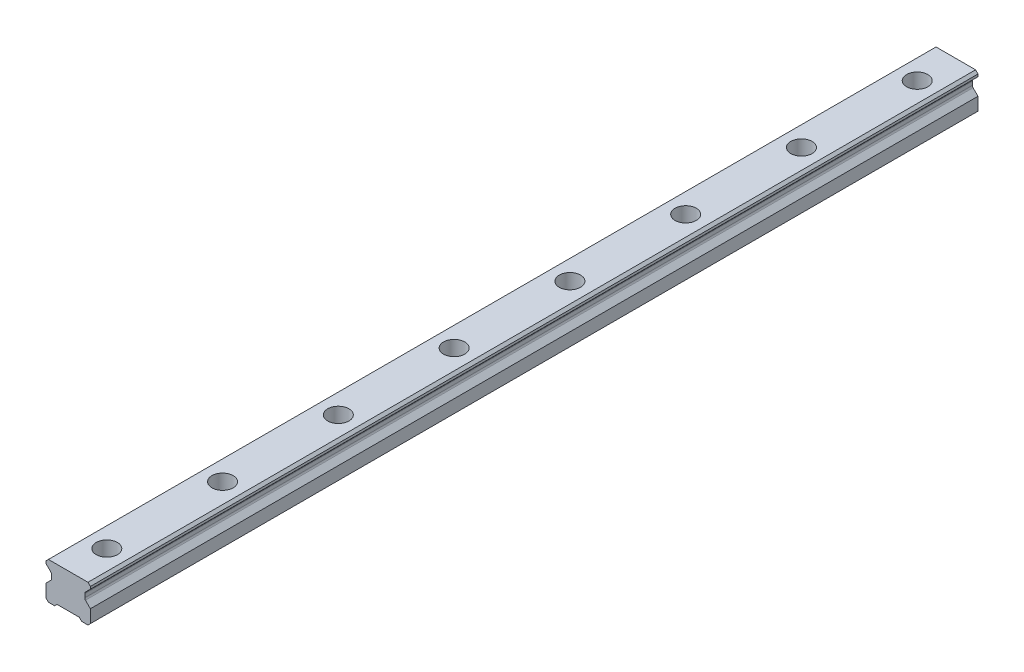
ISO-10303-21;
HEADER;
FILE_DESCRIPTION(('STEP AP214'),'2;1');
FILE_NAME('part.step','',(''),(''),'','','');
FILE_SCHEMA(('AUTOMOTIVE_DESIGN { 1 0 10303 214 1 1 1 1 }'));
ENDSEC;
DATA;
#1=APPLICATION_CONTEXT('core data for automotive mechanical design processes');
#2=APPLICATION_PROTOCOL_DEFINITION('international standard','automotive_design',2000,#1);
#3=PRODUCT_CONTEXT('',#1,'mechanical');
#4=PRODUCT('Part','Part','',(#3));
#5=PRODUCT_RELATED_PRODUCT_CATEGORY('part','',(#4));
#6=PRODUCT_DEFINITION_FORMATION('','',#4);
#7=PRODUCT_DEFINITION_CONTEXT('part definition',#1,'design');
#8=PRODUCT_DEFINITION('design','',#6,#7);
#9=PRODUCT_DEFINITION_SHAPE('','',#8);
#10=(LENGTH_UNIT() NAMED_UNIT(*) SI_UNIT(.MILLI.,.METRE.));
#11=(NAMED_UNIT(*) PLANE_ANGLE_UNIT() SI_UNIT($,.RADIAN.));
#12=(NAMED_UNIT(*) SI_UNIT($,.STERADIAN.) SOLID_ANGLE_UNIT());
#13=UNCERTAINTY_MEASURE_WITH_UNIT(LENGTH_MEASURE(1.E-05),#10,'distance_accuracy_value','');
#14=(GEOMETRIC_REPRESENTATION_CONTEXT(3) GLOBAL_UNCERTAINTY_ASSIGNED_CONTEXT((#13)) GLOBAL_UNIT_ASSIGNED_CONTEXT((#10,
#11,#12)) REPRESENTATION_CONTEXT('',''));
#15=CARTESIAN_POINT('',(0.,0.,0.));
#16=DIRECTION('',(0.,0.,1.));
#17=DIRECTION('',(1.,0.,0.));
#18=AXIS2_PLACEMENT_3D('',#15,#16,#17);
#19=CARTESIAN_POINT('',(0.,10.2,-210.));
#20=DIRECTION('',(0.,1.,0.));
#21=DIRECTION('',(0.,0.,1.));
#22=AXIS2_PLACEMENT_3D('',#19,#20,#21);
#23=PLANE('',#22);
#24=CARTESIAN_POINT('',(0.,10.2,-210.));
#25=DIRECTION('',(0.,1.,0.));
#26=DIRECTION('',(0.,0.,1.));
#27=AXIS2_PLACEMENT_3D('',#24,#25,#26);
#28=CIRCLE('',#27,3.5);
#29=CARTESIAN_POINT('',(0.,10.2,-206.5));
#30=VERTEX_POINT('',#29);
#31=EDGE_CURVE('E406',#30,#30,#28,.T.);
#32=ORIENTED_EDGE('',*,*,#31,.F.);
#33=EDGE_LOOP('',(#32));
#34=FACE_BOUND('',#33,.T.);
#35=CARTESIAN_POINT('',(0.,10.2,-210.));
#36=DIRECTION('',(0.,1.,0.));
#37=DIRECTION('',(0.,0.,1.));
#38=AXIS2_PLACEMENT_3D('',#35,#36,#37);
#39=CIRCLE('',#38,5.5);
#40=CARTESIAN_POINT('',(0.,10.2,-204.5));
#41=VERTEX_POINT('',#40);
#42=EDGE_CURVE('E11',#41,#41,#39,.T.);
#43=ORIENTED_EDGE('',*,*,#42,.T.);
#44=EDGE_LOOP('',(#43));
#45=FACE_BOUND('',#44,.T.);
#46=ADVANCED_FACE('F39',(#34,#45),#23,.T.);
#47=CARTESIAN_POINT('',(0.,10.2,-210.));
#48=DIRECTION('',(0.,1.,0.));
#49=DIRECTION('',(0.,0.,1.));
#50=AXIS2_PLACEMENT_3D('',#47,#48,#49);
#51=CYLINDRICAL_SURFACE('',#50,5.5);
#52=ORIENTED_EDGE('',*,*,#42,.F.);
#53=EDGE_LOOP('',(#52));
#54=FACE_BOUND('',#53,.T.);
#55=CARTESIAN_POINT('',(0.,19.2,-210.));
#56=DIRECTION('',(0.,1.,0.));
#57=DIRECTION('',(0.,0.,1.));
#58=AXIS2_PLACEMENT_3D('',#55,#56,#57);
#59=CIRCLE('',#58,5.5);
#60=CARTESIAN_POINT('',(0.,19.2,-204.5));
#61=VERTEX_POINT('',#60);
#62=EDGE_CURVE('E48',#61,#61,#59,.T.);
#63=ORIENTED_EDGE('',*,*,#62,.T.);
#64=EDGE_LOOP('',(#63));
#65=FACE_BOUND('',#64,.T.);
#66=ADVANCED_FACE('F663',(#54,#65),#51,.F.);
#67=CARTESIAN_POINT('',(0.,10.2,-150.));
#68=DIRECTION('',(0.,1.,0.));
#69=DIRECTION('',(0.,0.,1.));
#70=AXIS2_PLACEMENT_3D('',#67,#68,#69);
#71=PLANE('',#70);
#72=CARTESIAN_POINT('',(0.,10.2,-150.));
#73=DIRECTION('',(0.,1.,0.));
#74=DIRECTION('',(0.,0.,1.));
#75=AXIS2_PLACEMENT_3D('',#72,#73,#74);
#76=CIRCLE('',#75,3.5);
#77=CARTESIAN_POINT('',(0.,10.2,-146.5));
#78=VERTEX_POINT('',#77);
#79=EDGE_CURVE('E411',#78,#78,#76,.T.);
#80=ORIENTED_EDGE('',*,*,#79,.F.);
#81=EDGE_LOOP('',(#80));
#82=FACE_BOUND('',#81,.T.);
#83=CARTESIAN_POINT('',(0.,10.2,-150.));
#84=DIRECTION('',(0.,1.,0.));
#85=DIRECTION('',(0.,0.,1.));
#86=AXIS2_PLACEMENT_3D('',#83,#84,#85);
#87=CIRCLE('',#86,5.5);
#88=CARTESIAN_POINT('',(0.,10.2,-144.5));
#89=VERTEX_POINT('',#88);
#90=EDGE_CURVE('E390',#89,#89,#87,.T.);
#91=ORIENTED_EDGE('',*,*,#90,.T.);
#92=EDGE_LOOP('',(#91));
#93=FACE_BOUND('',#92,.T.);
#94=ADVANCED_FACE('F659',(#82,#93),#71,.T.);
#95=CARTESIAN_POINT('',(0.,10.2,-150.));
#96=DIRECTION('',(0.,1.,0.));
#97=DIRECTION('',(0.,0.,1.));
#98=AXIS2_PLACEMENT_3D('',#95,#96,#97);
#99=CYLINDRICAL_SURFACE('',#98,5.5);
#100=ORIENTED_EDGE('',*,*,#90,.F.);
#101=EDGE_LOOP('',(#100));
#102=FACE_BOUND('',#101,.T.);
#103=CARTESIAN_POINT('',(0.,19.2,-150.));
#104=DIRECTION('',(0.,1.,0.));
#105=DIRECTION('',(0.,0.,1.));
#106=AXIS2_PLACEMENT_3D('',#103,#104,#105);
#107=CIRCLE('',#106,5.5);
#108=CARTESIAN_POINT('',(0.,19.2,-144.5));
#109=VERTEX_POINT('',#108);
#110=EDGE_CURVE('E386',#109,#109,#107,.T.);
#111=ORIENTED_EDGE('',*,*,#110,.T.);
#112=EDGE_LOOP('',(#111));
#113=FACE_BOUND('',#112,.T.);
#114=ADVANCED_FACE('F662',(#102,#113),#99,.F.);
#115=CARTESIAN_POINT('',(0.,10.2,-90.));
#116=DIRECTION('',(0.,1.,0.));
#117=DIRECTION('',(0.,0.,1.));
#118=AXIS2_PLACEMENT_3D('',#115,#116,#117);
#119=PLANE('',#118);
#120=CARTESIAN_POINT('',(0.,10.2,-90.));
#121=DIRECTION('',(0.,1.,0.));
#122=DIRECTION('',(0.,0.,1.));
#123=AXIS2_PLACEMENT_3D('',#120,#121,#122);
#124=CIRCLE('',#123,3.5);
#125=CARTESIAN_POINT('',(0.,10.2,-86.5));
#126=VERTEX_POINT('',#125);
#127=EDGE_CURVE('E416',#126,#126,#124,.T.);
#128=ORIENTED_EDGE('',*,*,#127,.F.);
#129=EDGE_LOOP('',(#128));
#130=FACE_BOUND('',#129,.T.);
#131=CARTESIAN_POINT('',(0.,10.2,-90.));
#132=DIRECTION('',(0.,1.,0.));
#133=DIRECTION('',(0.,0.,1.));
#134=AXIS2_PLACEMENT_3D('',#131,#132,#133);
#135=CIRCLE('',#134,5.5);
#136=CARTESIAN_POINT('',(0.,10.2,-84.5));
#137=VERTEX_POINT('',#136);
#138=EDGE_CURVE('E382',#137,#137,#135,.T.);
#139=ORIENTED_EDGE('',*,*,#138,.T.);
#140=EDGE_LOOP('',(#139));
#141=FACE_BOUND('',#140,.T.);
#142=ADVANCED_FACE('F669',(#130,#141),#119,.T.);
#143=CARTESIAN_POINT('',(0.,10.2,-90.));
#144=DIRECTION('',(0.,1.,0.));
#145=DIRECTION('',(0.,0.,1.));
#146=AXIS2_PLACEMENT_3D('',#143,#144,#145);
#147=CYLINDRICAL_SURFACE('',#146,5.5);
#148=ORIENTED_EDGE('',*,*,#138,.F.);
#149=EDGE_LOOP('',(#148));
#150=FACE_BOUND('',#149,.T.);
#151=CARTESIAN_POINT('',(0.,19.2,-90.));
#152=DIRECTION('',(0.,1.,0.));
#153=DIRECTION('',(0.,0.,1.));
#154=AXIS2_PLACEMENT_3D('',#151,#152,#153);
#155=CIRCLE('',#154,5.5);
#156=CARTESIAN_POINT('',(0.,19.2,-84.5));
#157=VERTEX_POINT('',#156);
#158=EDGE_CURVE('E378',#157,#157,#155,.T.);
#159=ORIENTED_EDGE('',*,*,#158,.T.);
#160=EDGE_LOOP('',(#159));
#161=FACE_BOUND('',#160,.T.);
#162=ADVANCED_FACE('F690',(#150,#161),#147,.F.);
#163=CARTESIAN_POINT('',(0.,10.2,-30.));
#164=DIRECTION('',(0.,1.,0.));
#165=DIRECTION('',(0.,0.,1.));
#166=AXIS2_PLACEMENT_3D('',#163,#164,#165);
#167=PLANE('',#166);
#168=CARTESIAN_POINT('',(0.,10.2,-30.));
#169=DIRECTION('',(0.,1.,0.));
#170=DIRECTION('',(0.,0.,1.));
#171=AXIS2_PLACEMENT_3D('',#168,#169,#170);
#172=CIRCLE('',#171,3.5);
#173=CARTESIAN_POINT('',(0.,10.2,-26.5));
#174=VERTEX_POINT('',#173);
#175=EDGE_CURVE('E420',#174,#174,#172,.T.);
#176=ORIENTED_EDGE('',*,*,#175,.F.);
#177=EDGE_LOOP('',(#176));
#178=FACE_BOUND('',#177,.T.);
#179=CARTESIAN_POINT('',(0.,10.2,-30.));
#180=DIRECTION('',(0.,1.,0.));
#181=DIRECTION('',(0.,0.,1.));
#182=AXIS2_PLACEMENT_3D('',#179,#180,#181);
#183=CIRCLE('',#182,5.5);
#184=CARTESIAN_POINT('',(0.,10.2,-24.5));
#185=VERTEX_POINT('',#184);
#186=EDGE_CURVE('E374',#185,#185,#183,.T.);
#187=ORIENTED_EDGE('',*,*,#186,.T.);
#188=EDGE_LOOP('',(#187));
#189=FACE_BOUND('',#188,.T.);
#190=ADVANCED_FACE('F694',(#178,#189),#167,.T.);
#191=CARTESIAN_POINT('',(0.,10.2,-30.));
#192=DIRECTION('',(0.,1.,0.));
#193=DIRECTION('',(0.,0.,1.));
#194=AXIS2_PLACEMENT_3D('',#191,#192,#193);
#195=CYLINDRICAL_SURFACE('',#194,5.5);
#196=ORIENTED_EDGE('',*,*,#186,.F.);
#197=EDGE_LOOP('',(#196));
#198=FACE_BOUND('',#197,.T.);
#199=CARTESIAN_POINT('',(0.,19.2,-30.));
#200=DIRECTION('',(0.,1.,0.));
#201=DIRECTION('',(0.,0.,1.));
#202=AXIS2_PLACEMENT_3D('',#199,#200,#201);
#203=CIRCLE('',#202,5.5);
#204=CARTESIAN_POINT('',(0.,19.2,-24.5));
#205=VERTEX_POINT('',#204);
#206=EDGE_CURVE('E370',#205,#205,#203,.T.);
#207=ORIENTED_EDGE('',*,*,#206,.T.);
#208=EDGE_LOOP('',(#207));
#209=FACE_BOUND('',#208,.T.);
#210=ADVANCED_FACE('F698',(#198,#209),#195,.F.);
#211=CARTESIAN_POINT('',(0.,10.2,30.));
#212=DIRECTION('',(0.,1.,0.));
#213=DIRECTION('',(0.,0.,1.));
#214=AXIS2_PLACEMENT_3D('',#211,#212,#213);
#215=PLANE('',#214);
#216=CARTESIAN_POINT('',(0.,10.2,30.));
#217=DIRECTION('',(0.,1.,0.));
#218=DIRECTION('',(0.,0.,1.));
#219=AXIS2_PLACEMENT_3D('',#216,#217,#218);
#220=CIRCLE('',#219,3.5);
#221=CARTESIAN_POINT('',(0.,10.2,33.5));
#222=VERTEX_POINT('',#221);
#223=EDGE_CURVE('E424',#222,#222,#220,.T.);
#224=ORIENTED_EDGE('',*,*,#223,.F.);
#225=EDGE_LOOP('',(#224));
#226=FACE_BOUND('',#225,.T.);
#227=CARTESIAN_POINT('',(0.,10.2,30.));
#228=DIRECTION('',(0.,1.,0.));
#229=DIRECTION('',(0.,0.,1.));
#230=AXIS2_PLACEMENT_3D('',#227,#228,#229);
#231=CIRCLE('',#230,5.5);
#232=CARTESIAN_POINT('',(0.,10.2,35.5));
#233=VERTEX_POINT('',#232);
#234=EDGE_CURVE('E366',#233,#233,#231,.T.);
#235=ORIENTED_EDGE('',*,*,#234,.T.);
#236=EDGE_LOOP('',(#235));
#237=FACE_BOUND('',#236,.T.);
#238=ADVANCED_FACE('F702',(#226,#237),#215,.T.);
#239=CARTESIAN_POINT('',(0.,10.2,30.));
#240=DIRECTION('',(0.,1.,0.));
#241=DIRECTION('',(0.,0.,1.));
#242=AXIS2_PLACEMENT_3D('',#239,#240,#241);
#243=CYLINDRICAL_SURFACE('',#242,5.5);
#244=ORIENTED_EDGE('',*,*,#234,.F.);
#245=EDGE_LOOP('',(#244));
#246=FACE_BOUND('',#245,.T.);
#247=CARTESIAN_POINT('',(0.,19.2,30.));
#248=DIRECTION('',(0.,1.,0.));
#249=DIRECTION('',(0.,0.,1.));
#250=AXIS2_PLACEMENT_3D('',#247,#248,#249);
#251=CIRCLE('',#250,5.5);
#252=CARTESIAN_POINT('',(0.,19.2,35.5));
#253=VERTEX_POINT('',#252);
#254=EDGE_CURVE('E362',#253,#253,#251,.T.);
#255=ORIENTED_EDGE('',*,*,#254,.T.);
#256=EDGE_LOOP('',(#255));
#257=FACE_BOUND('',#256,.T.);
#258=ADVANCED_FACE('F706',(#246,#257),#243,.F.);
#259=CARTESIAN_POINT('',(0.,10.2,90.));
#260=DIRECTION('',(0.,1.,0.));
#261=DIRECTION('',(0.,0.,1.));
#262=AXIS2_PLACEMENT_3D('',#259,#260,#261);
#263=PLANE('',#262);
#264=CARTESIAN_POINT('',(0.,10.2,90.));
#265=DIRECTION('',(0.,1.,0.));
#266=DIRECTION('',(0.,0.,1.));
#267=AXIS2_PLACEMENT_3D('',#264,#265,#266);
#268=CIRCLE('',#267,3.5);
#269=CARTESIAN_POINT('',(0.,10.2,93.5));
#270=VERTEX_POINT('',#269);
#271=EDGE_CURVE('E439',#270,#270,#268,.T.);
#272=ORIENTED_EDGE('',*,*,#271,.F.);
#273=EDGE_LOOP('',(#272));
#274=FACE_BOUND('',#273,.T.);
#275=CARTESIAN_POINT('',(0.,10.2,90.));
#276=DIRECTION('',(0.,1.,0.));
#277=DIRECTION('',(0.,0.,1.));
#278=AXIS2_PLACEMENT_3D('',#275,#276,#277);
#279=CIRCLE('',#278,5.5);
#280=CARTESIAN_POINT('',(0.,10.2,95.5));
#281=VERTEX_POINT('',#280);
#282=EDGE_CURVE('E358',#281,#281,#279,.T.);
#283=ORIENTED_EDGE('',*,*,#282,.T.);
#284=EDGE_LOOP('',(#283));
#285=FACE_BOUND('',#284,.T.);
#286=ADVANCED_FACE('F710',(#274,#285),#263,.T.);
#287=CARTESIAN_POINT('',(0.,10.2,90.));
#288=DIRECTION('',(0.,1.,0.));
#289=DIRECTION('',(0.,0.,1.));
#290=AXIS2_PLACEMENT_3D('',#287,#288,#289);
#291=CYLINDRICAL_SURFACE('',#290,5.5);
#292=ORIENTED_EDGE('',*,*,#282,.F.);
#293=EDGE_LOOP('',(#292));
#294=FACE_BOUND('',#293,.T.);
#295=CARTESIAN_POINT('',(0.,19.2,90.));
#296=DIRECTION('',(0.,1.,0.));
#297=DIRECTION('',(0.,0.,1.));
#298=AXIS2_PLACEMENT_3D('',#295,#296,#297);
#299=CIRCLE('',#298,5.5);
#300=CARTESIAN_POINT('',(0.,19.2,95.5));
#301=VERTEX_POINT('',#300);
#302=EDGE_CURVE('E354',#301,#301,#299,.T.);
#303=ORIENTED_EDGE('',*,*,#302,.T.);
#304=EDGE_LOOP('',(#303));
#305=FACE_BOUND('',#304,.T.);
#306=ADVANCED_FACE('F714',(#294,#305),#291,.F.);
#307=CARTESIAN_POINT('',(11.5,0.,230.));
#308=DIRECTION('',(0.,1.,0.));
#309=DIRECTION('',(-1.,0.,0.));
#310=AXIS2_PLACEMENT_3D('',#307,#308,#309);
#311=PLANE('',#310);
#312=DIRECTION('',(1.,0.,0.));
#313=VECTOR('',#312,1.);
#314=CARTESIAN_POINT('',(11.5,0.,-230.));
#315=LINE('',#314,#313);
#316=CARTESIAN_POINT('',(-10.25,0.,-230.));
#317=VERTEX_POINT('',#316);
#318=CARTESIAN_POINT('',(-7.,0.,-230.));
#319=VERTEX_POINT('',#318);
#320=EDGE_CURVE('E229',#317,#319,#315,.T.);
#321=ORIENTED_EDGE('',*,*,#320,.T.);
#322=DIRECTION('',(0.,0.,1.));
#323=VECTOR('',#322,1.);
#324=CARTESIAN_POINT('',(-7.,0.,-230.));
#325=LINE('',#324,#323);
#326=CARTESIAN_POINT('',(-7.,0.,230.));
#327=VERTEX_POINT('',#326);
#328=EDGE_CURVE('E480',#319,#327,#325,.T.);
#329=ORIENTED_EDGE('',*,*,#328,.T.);
#330=DIRECTION('',(1.,0.,0.));
#331=VECTOR('',#330,1.);
#332=CARTESIAN_POINT('',(11.5,0.,230.));
#333=LINE('',#332,#331);
#334=CARTESIAN_POINT('',(-10.25,0.,230.));
#335=VERTEX_POINT('',#334);
#336=EDGE_CURVE('E549',#335,#327,#333,.T.);
#337=ORIENTED_EDGE('',*,*,#336,.F.);
#338=DIRECTION('',(0.,0.,-1.));
#339=VECTOR('',#338,1.);
#340=CARTESIAN_POINT('',(-10.25,0.,230.));
#341=LINE('',#340,#339);
#342=EDGE_CURVE('E289',#335,#317,#341,.T.);
#343=ORIENTED_EDGE('',*,*,#342,.T.);
#344=EDGE_LOOP('',(#321,#329,#337,#343));
#345=FACE_BOUND('',#344,.T.);
#346=ADVANCED_FACE('F718',(#345),#311,.F.);
#347=CARTESIAN_POINT('',(-11.5,19.2,230.));
#348=DIRECTION('',(1.,0.,0.));
#349=DIRECTION('',(0.,1.,0.));
#350=AXIS2_PLACEMENT_3D('',#347,#348,#349);
#351=PLANE('',#350);
#352=DIRECTION('',(0.,-1.,0.));
#353=VECTOR('',#352,1.);
#354=CARTESIAN_POINT('',(-11.5,19.2,230.));
#355=LINE('',#354,#353);
#356=CARTESIAN_POINT('',(-11.5,17.95,230.));
#357=VERTEX_POINT('',#356);
#358=CARTESIAN_POINT('',(-11.5,16.7,230.));
#359=VERTEX_POINT('',#358);
#360=EDGE_CURVE('E545',#357,#359,#355,.T.);
#361=ORIENTED_EDGE('',*,*,#360,.F.);
#362=DIRECTION('',(0.,0.,-1.));
#363=VECTOR('',#362,1.);
#364=CARTESIAN_POINT('',(-11.5,17.95,230.));
#365=LINE('',#364,#363);
#366=CARTESIAN_POINT('',(-11.5,17.95,-230.));
#367=VERTEX_POINT('',#366);
#368=EDGE_CURVE('E251',#357,#367,#365,.T.);
#369=ORIENTED_EDGE('',*,*,#368,.T.);
#370=DIRECTION('',(0.,-1.,0.));
#371=VECTOR('',#370,1.);
#372=CARTESIAN_POINT('',(-11.5,19.2,-230.));
#373=LINE('',#372,#371);
#374=CARTESIAN_POINT('',(-11.5,16.7,-230.));
#375=VERTEX_POINT('',#374);
#376=EDGE_CURVE('E230',#367,#375,#373,.T.);
#377=ORIENTED_EDGE('',*,*,#376,.T.);
#378=DIRECTION('',(0.,0.,1.));
#379=VECTOR('',#378,1.);
#380=CARTESIAN_POINT('',(-11.5,16.7,-230.));
#381=LINE('',#380,#379);
#382=EDGE_CURVE('E500',#375,#359,#381,.T.);
#383=ORIENTED_EDGE('',*,*,#382,.T.);
#384=EDGE_LOOP('',(#361,#369,#377,#383));
#385=FACE_BOUND('',#384,.T.);
#386=ADVANCED_FACE('F574',(#385),#351,.F.);
#387=CARTESIAN_POINT('',(11.5,19.2,230.));
#388=DIRECTION('',(-1.,0.,0.));
#389=DIRECTION('',(0.,0.,1.));
#390=AXIS2_PLACEMENT_3D('',#387,#388,#389);
#391=PLANE('',#390);
#392=DIRECTION('',(0.,1.,0.));
#393=VECTOR('',#392,1.);
#394=CARTESIAN_POINT('',(11.5,19.2,230.));
#395=LINE('',#394,#393);
#396=CARTESIAN_POINT('',(11.5,1.25000000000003,230.));
#397=VERTEX_POINT('',#396);
#398=CARTESIAN_POINT('',(11.5,7.95,230.));
#399=VERTEX_POINT('',#398);
#400=EDGE_CURVE('E554',#397,#399,#395,.T.);
#401=ORIENTED_EDGE('',*,*,#400,.F.);
#402=DIRECTION('',(0.,0.,-1.));
#403=VECTOR('',#402,1.);
#404=CARTESIAN_POINT('',(11.5,1.25000000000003,230.));
#405=LINE('',#404,#403);
#406=CARTESIAN_POINT('',(11.5,1.25000000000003,-230.));
#407=VERTEX_POINT('',#406);
#408=EDGE_CURVE('E296',#397,#407,#405,.T.);
#409=ORIENTED_EDGE('',*,*,#408,.T.);
#410=DIRECTION('',(0.,1.,0.));
#411=VECTOR('',#410,1.);
#412=CARTESIAN_POINT('',(11.5,19.2,-230.));
#413=LINE('',#412,#411);
#414=CARTESIAN_POINT('',(11.5,7.95,-230.));
#415=VERTEX_POINT('',#414);
#416=EDGE_CURVE('E243',#407,#415,#413,.T.);
#417=ORIENTED_EDGE('',*,*,#416,.T.);
#418=DIRECTION('',(0.,0.,1.));
#419=VECTOR('',#418,1.);
#420=CARTESIAN_POINT('',(11.5,7.95,-230.));
#421=LINE('',#420,#419);
#422=EDGE_CURVE('E530',#415,#399,#421,.T.);
#423=ORIENTED_EDGE('',*,*,#422,.T.);
#424=EDGE_LOOP('',(#401,#409,#417,#423));
#425=FACE_BOUND('',#424,.T.);
#426=ADVANCED_FACE('F616',(#425),#391,.F.);
#427=CARTESIAN_POINT('',(-11.5,7.95,-230.));
#428=VERTEX_POINT('',#427);
#429=CARTESIAN_POINT('',(-11.5,1.25000000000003,-230.));
#430=VERTEX_POINT('',#429);
#431=EDGE_CURVE('E239',#428,#430,#373,.T.);
#432=ORIENTED_EDGE('',*,*,#431,.T.);
#433=DIRECTION('',(0.,0.,1.));
#434=VECTOR('',#433,1.);
#435=CARTESIAN_POINT('',(-11.5,1.25000000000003,230.));
#436=LINE('',#435,#434);
#437=CARTESIAN_POINT('',(-11.5,1.25000000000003,230.));
#438=VERTEX_POINT('',#437);
#439=EDGE_CURVE('E293',#430,#438,#436,.T.);
#440=ORIENTED_EDGE('',*,*,#439,.T.);
#441=CARTESIAN_POINT('',(-11.5,7.95,230.));
#442=VERTEX_POINT('',#441);
#443=EDGE_CURVE('E250',#442,#438,#355,.T.);
#444=ORIENTED_EDGE('',*,*,#443,.F.);
#445=DIRECTION('',(0.,0.,1.));
#446=VECTOR('',#445,1.);
#447=CARTESIAN_POINT('',(-11.5,7.95,-230.));
#448=LINE('',#447,#446);
#449=EDGE_CURVE('E512',#428,#442,#448,.T.);
#450=ORIENTED_EDGE('',*,*,#449,.F.);
#451=EDGE_LOOP('',(#432,#440,#444,#450));
#452=FACE_BOUND('',#451,.T.);
#453=ADVANCED_FACE('F602',(#452),#351,.F.);
#454=CARTESIAN_POINT('',(7.,0.,230.));
#455=VERTEX_POINT('',#454);
#456=CARTESIAN_POINT('',(10.25,0.,230.));
#457=VERTEX_POINT('',#456);
#458=EDGE_CURVE('E219',#455,#457,#333,.T.);
#459=ORIENTED_EDGE('',*,*,#458,.F.);
#460=DIRECTION('',(0.,0.,1.));
#461=VECTOR('',#460,1.);
#462=CARTESIAN_POINT('',(7.,0.,-230.));
#463=LINE('',#462,#461);
#464=CARTESIAN_POINT('',(7.,0.,-230.));
#465=VERTEX_POINT('',#464);
#466=EDGE_CURVE('E206',#465,#455,#463,.T.);
#467=ORIENTED_EDGE('',*,*,#466,.F.);
#468=CARTESIAN_POINT('',(10.25,0.,-230.));
#469=VERTEX_POINT('',#468);
#470=EDGE_CURVE('E217',#465,#469,#315,.T.);
#471=ORIENTED_EDGE('',*,*,#470,.T.);
#472=DIRECTION('',(0.,0.,1.));
#473=VECTOR('',#472,1.);
#474=CARTESIAN_POINT('',(10.25,0.,230.));
#475=LINE('',#474,#473);
#476=EDGE_CURVE('E286',#469,#457,#475,.T.);
#477=ORIENTED_EDGE('',*,*,#476,.T.);
#478=EDGE_LOOP('',(#459,#467,#471,#477));
#479=FACE_BOUND('',#478,.T.);
#480=ADVANCED_FACE('F215',(#479),#311,.F.);
#481=CARTESIAN_POINT('',(11.5,16.7,-230.));
#482=VERTEX_POINT('',#481);
#483=CARTESIAN_POINT('',(11.5,17.95,-230.));
#484=VERTEX_POINT('',#483);
#485=EDGE_CURVE('E236',#482,#484,#413,.T.);
#486=ORIENTED_EDGE('',*,*,#485,.T.);
#487=DIRECTION('',(0.,0.,1.));
#488=VECTOR('',#487,1.);
#489=CARTESIAN_POINT('',(11.5,17.95,230.));
#490=LINE('',#489,#488);
#491=CARTESIAN_POINT('',(11.5,17.95,230.));
#492=VERTEX_POINT('',#491);
#493=EDGE_CURVE('E300',#484,#492,#490,.T.);
#494=ORIENTED_EDGE('',*,*,#493,.T.);
#495=CARTESIAN_POINT('',(11.5,16.7,230.));
#496=VERTEX_POINT('',#495);
#497=EDGE_CURVE('E553',#496,#492,#395,.T.);
#498=ORIENTED_EDGE('',*,*,#497,.F.);
#499=DIRECTION('',(0.,0.,1.));
#500=VECTOR('',#499,1.);
#501=CARTESIAN_POINT('',(11.5,16.7,-230.));
#502=LINE('',#501,#500);
#503=EDGE_CURVE('E505',#482,#496,#502,.T.);
#504=ORIENTED_EDGE('',*,*,#503,.F.);
#505=EDGE_LOOP('',(#486,#494,#498,#504));
#506=FACE_BOUND('',#505,.T.);
#507=ADVANCED_FACE('F644',(#506),#391,.F.);
#508=CARTESIAN_POINT('',(11.5,19.2,230.));
#509=DIRECTION('',(0.,-1.,0.));
#510=DIRECTION('',(0.,0.,-1.));
#511=AXIS2_PLACEMENT_3D('',#508,#509,#510);
#512=PLANE('',#511);
#513=CARTESIAN_POINT('',(0.,19.2,150.));
#514=DIRECTION('',(0.,1.,0.));
#515=DIRECTION('',(0.,0.,1.));
#516=AXIS2_PLACEMENT_3D('',#513,#514,#515);
#517=CIRCLE('',#516,5.5);
#518=CARTESIAN_POINT('',(0.,19.2,155.5));
#519=VERTEX_POINT('',#518);
#520=EDGE_CURVE('E443',#519,#519,#517,.T.);
#521=ORIENTED_EDGE('',*,*,#520,.F.);
#522=EDGE_LOOP('',(#521));
#523=FACE_BOUND('',#522,.T.);
#524=CARTESIAN_POINT('',(0.,19.2,210.));
#525=DIRECTION('',(0.,1.,0.));
#526=DIRECTION('',(0.,0.,1.));
#527=AXIS2_PLACEMENT_3D('',#524,#525,#526);
#528=CIRCLE('',#527,5.5);
#529=CARTESIAN_POINT('',(0.,19.2,215.5));
#530=VERTEX_POINT('',#529);
#531=EDGE_CURVE('E459',#530,#530,#528,.T.);
#532=ORIENTED_EDGE('',*,*,#531,.F.);
#533=EDGE_LOOP('',(#532));
#534=FACE_BOUND('',#533,.T.);
#535=DIRECTION('',(-1.,0.,0.));
#536=VECTOR('',#535,1.);
#537=CARTESIAN_POINT('',(11.5,19.2,-230.));
#538=LINE('',#537,#536);
#539=CARTESIAN_POINT('',(10.25,19.2,-230.));
#540=VERTEX_POINT('',#539);
#541=CARTESIAN_POINT('',(-10.25,19.2,-230.));
#542=VERTEX_POINT('',#541);
#543=EDGE_CURVE('E247',#540,#542,#538,.T.);
#544=ORIENTED_EDGE('',*,*,#543,.T.);
#545=DIRECTION('',(0.,0.,1.));
#546=VECTOR('',#545,1.);
#547=CARTESIAN_POINT('',(-10.25,19.2,230.));
#548=LINE('',#547,#546);
#549=CARTESIAN_POINT('',(-10.25,19.2,230.));
#550=VERTEX_POINT('',#549);
#551=EDGE_CURVE('E271',#542,#550,#548,.T.);
#552=ORIENTED_EDGE('',*,*,#551,.T.);
#553=DIRECTION('',(-1.,0.,0.));
#554=VECTOR('',#553,1.);
#555=CARTESIAN_POINT('',(11.5,19.2,230.));
#556=LINE('',#555,#554);
#557=CARTESIAN_POINT('',(10.25,19.2,230.));
#558=VERTEX_POINT('',#557);
#559=EDGE_CURVE('E256',#558,#550,#556,.T.);
#560=ORIENTED_EDGE('',*,*,#559,.F.);
#561=DIRECTION('',(0.,0.,-1.));
#562=VECTOR('',#561,1.);
#563=CARTESIAN_POINT('',(10.25,19.2,230.));
#564=LINE('',#563,#562);
#565=EDGE_CURVE('E267',#558,#540,#564,.T.);
#566=ORIENTED_EDGE('',*,*,#565,.T.);
#567=EDGE_LOOP('',(#544,#552,#560,#566));
#568=FACE_BOUND('',#567,.T.);
#569=ORIENTED_EDGE('',*,*,#302,.F.);
#570=EDGE_LOOP('',(#569));
#571=FACE_BOUND('',#570,.T.);
#572=ORIENTED_EDGE('',*,*,#254,.F.);
#573=EDGE_LOOP('',(#572));
#574=FACE_BOUND('',#573,.T.);
#575=ORIENTED_EDGE('',*,*,#206,.F.);
#576=EDGE_LOOP('',(#575));
#577=FACE_BOUND('',#576,.T.);
#578=ORIENTED_EDGE('',*,*,#158,.F.);
#579=EDGE_LOOP('',(#578));
#580=FACE_BOUND('',#579,.T.);
#581=ORIENTED_EDGE('',*,*,#110,.F.);
#582=EDGE_LOOP('',(#581));
#583=FACE_BOUND('',#582,.T.);
#584=ORIENTED_EDGE('',*,*,#62,.F.);
#585=EDGE_LOOP('',(#584));
#586=FACE_BOUND('',#585,.T.);
#587=ADVANCED_FACE('F673',(#523,#534,#568,#571,#574,#577,#580,#583,#586),#512,.F.);
#588=CARTESIAN_POINT('',(0.,0.,230.));
#589=DIRECTION('',(0.,0.,-1.));
#590=DIRECTION('',(-1.,0.,0.));
#591=AXIS2_PLACEMENT_3D('',#588,#589,#590);
#592=PLANE('',#591);
#593=ORIENTED_EDGE('',*,*,#336,.T.);
#594=DIRECTION('',(-0.707106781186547,-0.707106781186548,0.));
#595=VECTOR('',#594,1.);
#596=CARTESIAN_POINT('',(-7.,0.,230.));
#597=LINE('',#596,#595);
#598=CARTESIAN_POINT('',(-5.75,1.25,230.));
#599=VERTEX_POINT('',#598);
#600=EDGE_CURVE('E211',#599,#327,#597,.T.);
#601=ORIENTED_EDGE('',*,*,#600,.F.);
#602=DIRECTION('',(-1.,0.,0.));
#603=VECTOR('',#602,1.);
#604=CARTESIAN_POINT('',(-5.75,1.25,230.));
#605=LINE('',#604,#603);
#606=CARTESIAN_POINT('',(5.75,1.25,230.));
#607=VERTEX_POINT('',#606);
#608=EDGE_CURVE('E474',#607,#599,#605,.T.);
#609=ORIENTED_EDGE('',*,*,#608,.F.);
#610=DIRECTION('',(-0.707106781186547,0.707106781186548,0.));
#611=VECTOR('',#610,1.);
#612=CARTESIAN_POINT('',(5.75,1.25,230.));
#613=LINE('',#612,#611);
#614=EDGE_CURVE('E464',#455,#607,#613,.T.);
#615=ORIENTED_EDGE('',*,*,#614,.F.);
#616=ORIENTED_EDGE('',*,*,#458,.T.);
#617=DIRECTION('',(-0.707106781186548,-0.707106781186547,0.));
#618=VECTOR('',#617,1.);
#619=CARTESIAN_POINT('',(11.5,1.25000000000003,230.));
#620=LINE('',#619,#618);
#621=EDGE_CURVE('E277',#457,#397,#620,.F.);
#622=ORIENTED_EDGE('',*,*,#621,.T.);
#623=ORIENTED_EDGE('',*,*,#400,.T.);
#624=DIRECTION('',(0.707106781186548,-0.707106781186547,0.));
#625=VECTOR('',#624,1.);
#626=CARTESIAN_POINT('',(11.5,7.95,230.));
#627=LINE('',#626,#625);
#628=CARTESIAN_POINT('',(8.94944985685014,10.5005501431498,230.));
#629=VERTEX_POINT('',#628);
#630=EDGE_CURVE('E483',#629,#399,#627,.T.);
#631=ORIENTED_EDGE('',*,*,#630,.F.);
#632=CARTESIAN_POINT('',(9.83333333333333,11.384433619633,230.));
#633=DIRECTION('',(0.,0.,-1.));
#634=DIRECTION('',(-1.,0.,0.));
#635=AXIS2_PLACEMENT_3D('',#632,#633,#634);
#636=CIRCLE('',#635,1.25);
#637=CARTESIAN_POINT('',(8.58333333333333,11.384433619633,230.));
#638=VERTEX_POINT('',#637);
#639=EDGE_CURVE('E331',#629,#638,#636,.T.);
#640=ORIENTED_EDGE('',*,*,#639,.T.);
#641=DIRECTION('',(0.,-1.,0.));
#642=VECTOR('',#641,1.);
#643=CARTESIAN_POINT('',(8.58333333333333,10.8666666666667,230.));
#644=LINE('',#643,#642);
#645=CARTESIAN_POINT('',(8.58333333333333,13.265566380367,230.));
#646=VERTEX_POINT('',#645);
#647=EDGE_CURVE('E522',#646,#638,#644,.T.);
#648=ORIENTED_EDGE('',*,*,#647,.F.);
#649=CARTESIAN_POINT('',(9.83333333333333,13.265566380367,230.));
#650=DIRECTION('',(0.,0.,-1.));
#651=DIRECTION('',(-1.,0.,0.));
#652=AXIS2_PLACEMENT_3D('',#649,#650,#651);
#653=CIRCLE('',#652,1.25);
#654=CARTESIAN_POINT('',(8.94944985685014,14.1494498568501,230.));
#655=VERTEX_POINT('',#654);
#656=EDGE_CURVE('E337',#646,#655,#653,.T.);
#657=ORIENTED_EDGE('',*,*,#656,.T.);
#658=DIRECTION('',(-0.707106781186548,-0.707106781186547,0.));
#659=VECTOR('',#658,1.);
#660=CARTESIAN_POINT('',(8.58333333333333,13.7833333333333,230.));
#661=LINE('',#660,#659);
#662=EDGE_CURVE('E533',#496,#655,#661,.T.);
#663=ORIENTED_EDGE('',*,*,#662,.F.);
#664=ORIENTED_EDGE('',*,*,#497,.T.);
#665=DIRECTION('',(0.707106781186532,-0.707106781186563,0.));
#666=VECTOR('',#665,1.);
#667=CARTESIAN_POINT('',(10.25,19.2,230.));
#668=LINE('',#667,#666);
#669=EDGE_CURVE('E274',#492,#558,#668,.F.);
#670=ORIENTED_EDGE('',*,*,#669,.T.);
#671=ORIENTED_EDGE('',*,*,#559,.T.);
#672=DIRECTION('',(0.707106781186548,0.707106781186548,0.));
#673=VECTOR('',#672,1.);
#674=CARTESIAN_POINT('',(-11.5,17.95,230.));
#675=LINE('',#674,#673);
#676=EDGE_CURVE('E283',#550,#357,#675,.F.);
#677=ORIENTED_EDGE('',*,*,#676,.T.);
#678=ORIENTED_EDGE('',*,*,#360,.T.);
#679=DIRECTION('',(-0.707106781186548,0.707106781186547,0.));
#680=VECTOR('',#679,1.);
#681=CARTESIAN_POINT('',(-8.58333333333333,13.7833333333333,230.));
#682=LINE('',#681,#680);
#683=CARTESIAN_POINT('',(-8.94944985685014,14.1494498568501,230.));
#684=VERTEX_POINT('',#683);
#685=EDGE_CURVE('E501',#684,#359,#682,.T.);
#686=ORIENTED_EDGE('',*,*,#685,.F.);
#687=CARTESIAN_POINT('',(-9.83333333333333,13.265566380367,230.));
#688=DIRECTION('',(0.,0.,-1.));
#689=DIRECTION('',(-1.,0.,0.));
#690=AXIS2_PLACEMENT_3D('',#687,#688,#689);
#691=CIRCLE('',#690,1.25);
#692=CARTESIAN_POINT('',(-8.58333333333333,13.265566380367,230.));
#693=VERTEX_POINT('',#692);
#694=EDGE_CURVE('E349',#684,#693,#691,.T.);
#695=ORIENTED_EDGE('',*,*,#694,.T.);
#696=DIRECTION('',(0.,1.,0.));
#697=VECTOR('',#696,1.);
#698=CARTESIAN_POINT('',(-8.58333333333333,10.8666666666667,230.));
#699=LINE('',#698,#697);
#700=CARTESIAN_POINT('',(-8.58333333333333,11.384433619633,230.));
#701=VERTEX_POINT('',#700);
#702=EDGE_CURVE('E493',#701,#693,#699,.T.);
#703=ORIENTED_EDGE('',*,*,#702,.F.);
#704=CARTESIAN_POINT('',(-9.83333333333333,11.384433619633,230.));
#705=DIRECTION('',(0.,0.,-1.));
#706=DIRECTION('',(-1.,0.,0.));
#707=AXIS2_PLACEMENT_3D('',#704,#705,#706);
#708=CIRCLE('',#707,1.25);
#709=CARTESIAN_POINT('',(-8.94944985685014,10.5005501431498,230.));
#710=VERTEX_POINT('',#709);
#711=EDGE_CURVE('E343',#701,#710,#708,.T.);
#712=ORIENTED_EDGE('',*,*,#711,.T.);
#713=DIRECTION('',(0.707106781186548,0.707106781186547,0.));
#714=VECTOR('',#713,1.);
#715=CARTESIAN_POINT('',(-11.5,7.95,230.));
#716=LINE('',#715,#714);
#717=EDGE_CURVE('E504',#442,#710,#716,.T.);
#718=ORIENTED_EDGE('',*,*,#717,.F.);
#719=ORIENTED_EDGE('',*,*,#443,.T.);
#720=DIRECTION('',(-0.707106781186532,0.707106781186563,0.));
#721=VECTOR('',#720,1.);
#722=CARTESIAN_POINT('',(-10.25,0.,230.));
#723=LINE('',#722,#721);
#724=EDGE_CURVE('E280',#438,#335,#723,.F.);
#725=ORIENTED_EDGE('',*,*,#724,.T.);
#726=EDGE_LOOP('',(#593,#601,#609,#615,#616,#622,#623,#631,#640,#648,#657,#663,#664,#670,#671,
#677,#678,#686,#695,#703,#712,#718,#719,#725));
#727=FACE_BOUND('',#726,.T.);
#728=ADVANCED_FACE('F562',(#727),#592,.F.);
#729=CARTESIAN_POINT('',(0.,0.,-230.));
#730=DIRECTION('',(0.,0.,-1.));
#731=DIRECTION('',(-1.,0.,0.));
#732=AXIS2_PLACEMENT_3D('',#729,#730,#731);
#733=PLANE('',#732);
#734=DIRECTION('',(-0.707106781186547,-0.707106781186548,0.));
#735=VECTOR('',#734,1.);
#736=CARTESIAN_POINT('',(-7.,0.,-230.));
#737=LINE('',#736,#735);
#738=CARTESIAN_POINT('',(-5.75,1.25,-230.));
#739=VERTEX_POINT('',#738);
#740=EDGE_CURVE('E221',#739,#319,#737,.T.);
#741=ORIENTED_EDGE('',*,*,#740,.T.);
#742=ORIENTED_EDGE('',*,*,#320,.F.);
#743=DIRECTION('',(0.707106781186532,-0.707106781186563,0.));
#744=VECTOR('',#743,1.);
#745=CARTESIAN_POINT('',(-5.12500000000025,-5.12500000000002,-230.));
#746=LINE('',#745,#744);
#747=EDGE_CURVE('E261',#317,#430,#746,.F.);
#748=ORIENTED_EDGE('',*,*,#747,.T.);
#749=ORIENTED_EDGE('',*,*,#431,.F.);
#750=DIRECTION('',(0.707106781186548,0.707106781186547,0.));
#751=VECTOR('',#750,1.);
#752=CARTESIAN_POINT('',(-11.5,7.95,-230.));
#753=LINE('',#752,#751);
#754=CARTESIAN_POINT('',(-8.94944985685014,10.5005501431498,-230.));
#755=VERTEX_POINT('',#754);
#756=EDGE_CURVE('E492',#428,#755,#753,.T.);
#757=ORIENTED_EDGE('',*,*,#756,.T.);
#758=CARTESIAN_POINT('',(-9.83333333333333,11.384433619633,-230.));
#759=DIRECTION('',(0.,0.,-1.));
#760=DIRECTION('',(-1.,0.,0.));
#761=AXIS2_PLACEMENT_3D('',#758,#759,#760);
#762=CIRCLE('',#761,1.25);
#763=CARTESIAN_POINT('',(-8.58333333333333,11.384433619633,-230.));
#764=VERTEX_POINT('',#763);
#765=EDGE_CURVE('E346',#755,#764,#762,.F.);
#766=ORIENTED_EDGE('',*,*,#765,.T.);
#767=DIRECTION('',(0.,1.,0.));
#768=VECTOR('',#767,1.);
#769=CARTESIAN_POINT('',(-8.58333333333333,10.8666666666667,-230.));
#770=LINE('',#769,#768);
#771=CARTESIAN_POINT('',(-8.58333333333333,13.265566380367,-230.));
#772=VERTEX_POINT('',#771);
#773=EDGE_CURVE('E497',#764,#772,#770,.T.);
#774=ORIENTED_EDGE('',*,*,#773,.T.);
#775=CARTESIAN_POINT('',(-9.83333333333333,13.265566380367,-230.));
#776=DIRECTION('',(0.,0.,-1.));
#777=DIRECTION('',(-1.,0.,0.));
#778=AXIS2_PLACEMENT_3D('',#775,#776,#777);
#779=CIRCLE('',#778,1.25);
#780=CARTESIAN_POINT('',(-8.94944985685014,14.1494498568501,-230.));
#781=VERTEX_POINT('',#780);
#782=EDGE_CURVE('E64',#772,#781,#779,.F.);
#783=ORIENTED_EDGE('',*,*,#782,.T.);
#784=DIRECTION('',(-0.707106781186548,0.707106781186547,0.));
#785=VECTOR('',#784,1.);
#786=CARTESIAN_POINT('',(-8.58333333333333,13.7833333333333,-230.));
#787=LINE('',#786,#785);
#788=EDGE_CURVE('E489',#781,#375,#787,.T.);
#789=ORIENTED_EDGE('',*,*,#788,.T.);
#790=ORIENTED_EDGE('',*,*,#376,.F.);
#791=DIRECTION('',(-0.707106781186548,-0.707106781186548,0.));
#792=VECTOR('',#791,1.);
#793=CARTESIAN_POINT('',(-14.725,14.725,-230.));
#794=LINE('',#793,#792);
#795=EDGE_CURVE('E264',#367,#542,#794,.F.);
#796=ORIENTED_EDGE('',*,*,#795,.T.);
#797=ORIENTED_EDGE('',*,*,#543,.F.);
#798=DIRECTION('',(-0.707106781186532,0.707106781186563,0.));
#799=VECTOR('',#798,1.);
#800=CARTESIAN_POINT('',(14.7250000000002,14.7249999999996,-230.));
#801=LINE('',#800,#799);
#802=EDGE_CURVE('E255',#540,#484,#801,.F.);
#803=ORIENTED_EDGE('',*,*,#802,.T.);
#804=ORIENTED_EDGE('',*,*,#485,.F.);
#805=DIRECTION('',(-0.707106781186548,-0.707106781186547,0.));
#806=VECTOR('',#805,1.);
#807=CARTESIAN_POINT('',(8.58333333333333,13.7833333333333,-230.));
#808=LINE('',#807,#806);
#809=CARTESIAN_POINT('',(8.94944985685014,14.1494498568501,-230.));
#810=VERTEX_POINT('',#809);
#811=EDGE_CURVE('E521',#482,#810,#808,.T.);
#812=ORIENTED_EDGE('',*,*,#811,.T.);
#813=CARTESIAN_POINT('',(9.83333333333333,13.265566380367,-230.));
#814=DIRECTION('',(0.,0.,-1.));
#815=DIRECTION('',(-1.,0.,0.));
#816=AXIS2_PLACEMENT_3D('',#813,#814,#815);
#817=CIRCLE('',#816,1.25);
#818=CARTESIAN_POINT('',(8.58333333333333,13.265566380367,-230.));
#819=VERTEX_POINT('',#818);
#820=EDGE_CURVE('E340',#810,#819,#817,.F.);
#821=ORIENTED_EDGE('',*,*,#820,.T.);
#822=DIRECTION('',(0.,-1.,0.));
#823=VECTOR('',#822,1.);
#824=CARTESIAN_POINT('',(8.58333333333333,10.8666666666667,-230.));
#825=LINE('',#824,#823);
#826=CARTESIAN_POINT('',(8.58333333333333,11.384433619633,-230.));
#827=VERTEX_POINT('',#826);
#828=EDGE_CURVE('E526',#819,#827,#825,.T.);
#829=ORIENTED_EDGE('',*,*,#828,.T.);
#830=CARTESIAN_POINT('',(9.83333333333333,11.384433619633,-230.));
#831=DIRECTION('',(0.,0.,-1.));
#832=DIRECTION('',(-1.,0.,0.));
#833=AXIS2_PLACEMENT_3D('',#830,#831,#832);
#834=CIRCLE('',#833,1.25);
#835=CARTESIAN_POINT('',(8.94944985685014,10.5005501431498,-230.));
#836=VERTEX_POINT('',#835);
#837=EDGE_CURVE('E334',#827,#836,#834,.F.);
#838=ORIENTED_EDGE('',*,*,#837,.T.);
#839=DIRECTION('',(0.707106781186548,-0.707106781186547,0.));
#840=VECTOR('',#839,1.);
#841=CARTESIAN_POINT('',(11.5,7.95,-230.));
#842=LINE('',#841,#840);
#843=EDGE_CURVE('E518',#836,#415,#842,.T.);
#844=ORIENTED_EDGE('',*,*,#843,.T.);
#845=ORIENTED_EDGE('',*,*,#416,.F.);
#846=DIRECTION('',(0.707106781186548,0.707106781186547,0.));
#847=VECTOR('',#846,1.);
#848=CARTESIAN_POINT('',(5.12499999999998,-5.12499999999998,-230.));
#849=LINE('',#848,#847);
#850=EDGE_CURVE('E226',#407,#469,#849,.F.);
#851=ORIENTED_EDGE('',*,*,#850,.T.);
#852=ORIENTED_EDGE('',*,*,#470,.F.);
#853=DIRECTION('',(-0.707106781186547,0.707106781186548,0.));
#854=VECTOR('',#853,1.);
#855=CARTESIAN_POINT('',(5.75,1.25,-230.));
#856=LINE('',#855,#854);
#857=CARTESIAN_POINT('',(5.75,1.25,-230.));
#858=VERTEX_POINT('',#857);
#859=EDGE_CURVE('E202',#465,#858,#856,.T.);
#860=ORIENTED_EDGE('',*,*,#859,.T.);
#861=DIRECTION('',(-1.,0.,0.));
#862=VECTOR('',#861,1.);
#863=CARTESIAN_POINT('',(-5.75,1.25,-230.));
#864=LINE('',#863,#862);
#865=EDGE_CURVE('E56',#858,#739,#864,.T.);
#866=ORIENTED_EDGE('',*,*,#865,.T.);
#867=EDGE_LOOP('',(#741,#742,#748,#749,#757,#766,#774,#783,#789,#790,#796,#797,#803,#804,#812,
#821,#829,#838,#844,#845,#851,#852,#860,#866));
#868=FACE_BOUND('',#867,.T.);
#869=ADVANCED_FACE('F224',(#868),#733,.T.);
#870=CARTESIAN_POINT('',(11.5,7.95,-230.));
#871=DIRECTION('',(-0.707106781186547,-0.707106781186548,0.));
#872=DIRECTION('',(0.707106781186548,-0.707106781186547,0.));
#873=AXIS2_PLACEMENT_3D('',#870,#871,#872);
#874=PLANE('',#873);
#875=ORIENTED_EDGE('',*,*,#843,.F.);
#876=DIRECTION('',(0.,0.,1.));
#877=VECTOR('',#876,1.);
#878=CARTESIAN_POINT('',(8.94944985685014,10.5005501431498,230.));
#879=LINE('',#878,#877);
#880=EDGE_CURVE('E303',#836,#629,#879,.T.);
#881=ORIENTED_EDGE('',*,*,#880,.T.);
#882=ORIENTED_EDGE('',*,*,#630,.T.);
#883=ORIENTED_EDGE('',*,*,#422,.F.);
#884=EDGE_LOOP('',(#875,#881,#882,#883));
#885=FACE_BOUND('',#884,.T.);
#886=ADVANCED_FACE('F622',(#885),#874,.F.);
#887=CARTESIAN_POINT('',(8.58333333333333,10.8666666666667,-230.));
#888=DIRECTION('',(-1.,0.,0.));
#889=DIRECTION('',(0.,0.,1.));
#890=AXIS2_PLACEMENT_3D('',#887,#888,#889);
#891=PLANE('',#890);
#892=ORIENTED_EDGE('',*,*,#647,.T.);
#893=DIRECTION('',(0.,0.,1.));
#894=VECTOR('',#893,1.);
#895=CARTESIAN_POINT('',(8.58333333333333,11.384433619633,-230.));
#896=LINE('',#895,#894);
#897=EDGE_CURVE('E311',#638,#827,#896,.F.);
#898=ORIENTED_EDGE('',*,*,#897,.T.);
#899=ORIENTED_EDGE('',*,*,#828,.F.);
#900=DIRECTION('',(0.,0.,1.));
#901=VECTOR('',#900,1.);
#902=CARTESIAN_POINT('',(8.58333333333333,13.265566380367,230.));
#903=LINE('',#902,#901);
#904=EDGE_CURVE('E307',#819,#646,#903,.T.);
#905=ORIENTED_EDGE('',*,*,#904,.T.);
#906=EDGE_LOOP('',(#892,#898,#899,#905));
#907=FACE_BOUND('',#906,.T.);
#908=ADVANCED_FACE('F629',(#907),#891,.F.);
#909=CARTESIAN_POINT('',(8.58333333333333,13.7833333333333,-230.));
#910=DIRECTION('',(-0.707106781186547,0.707106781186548,0.));
#911=DIRECTION('',(-0.707106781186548,-0.707106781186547,0.));
#912=AXIS2_PLACEMENT_3D('',#909,#910,#911);
#913=PLANE('',#912);
#914=ORIENTED_EDGE('',*,*,#662,.T.);
#915=DIRECTION('',(0.,0.,1.));
#916=VECTOR('',#915,1.);
#917=CARTESIAN_POINT('',(8.94944985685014,14.1494498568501,-230.));
#918=LINE('',#917,#916);
#919=EDGE_CURVE('E314',#655,#810,#918,.F.);
#920=ORIENTED_EDGE('',*,*,#919,.T.);
#921=ORIENTED_EDGE('',*,*,#811,.F.);
#922=ORIENTED_EDGE('',*,*,#503,.T.);
#923=EDGE_LOOP('',(#914,#920,#921,#922));
#924=FACE_BOUND('',#923,.T.);
#925=ADVANCED_FACE('F639',(#924),#913,.F.);
#926=CARTESIAN_POINT('',(-8.58333333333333,13.7833333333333,-230.));
#927=DIRECTION('',(0.707106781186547,0.707106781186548,0.));
#928=DIRECTION('',(-0.707106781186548,0.707106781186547,0.));
#929=AXIS2_PLACEMENT_3D('',#926,#927,#928);
#930=PLANE('',#929);
#931=ORIENTED_EDGE('',*,*,#788,.F.);
#932=DIRECTION('',(0.,0.,1.));
#933=VECTOR('',#932,1.);
#934=CARTESIAN_POINT('',(-8.94944985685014,14.1494498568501,230.));
#935=LINE('',#934,#933);
#936=EDGE_CURVE('E327',#781,#684,#935,.T.);
#937=ORIENTED_EDGE('',*,*,#936,.T.);
#938=ORIENTED_EDGE('',*,*,#685,.T.);
#939=ORIENTED_EDGE('',*,*,#382,.F.);
#940=EDGE_LOOP('',(#931,#937,#938,#939));
#941=FACE_BOUND('',#940,.T.);
#942=ADVANCED_FACE('F579',(#941),#930,.F.);
#943=CARTESIAN_POINT('',(-8.58333333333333,10.8666666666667,-230.));
#944=DIRECTION('',(1.,0.,0.));
#945=DIRECTION('',(0.,0.,-1.));
#946=AXIS2_PLACEMENT_3D('',#943,#944,#945);
#947=PLANE('',#946);
#948=ORIENTED_EDGE('',*,*,#773,.F.);
#949=DIRECTION('',(0.,0.,1.));
#950=VECTOR('',#949,1.);
#951=CARTESIAN_POINT('',(-8.58333333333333,11.384433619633,230.));
#952=LINE('',#951,#950);
#953=EDGE_CURVE('E320',#764,#701,#952,.T.);
#954=ORIENTED_EDGE('',*,*,#953,.T.);
#955=ORIENTED_EDGE('',*,*,#702,.T.);
#956=DIRECTION('',(0.,0.,1.));
#957=VECTOR('',#956,1.);
#958=CARTESIAN_POINT('',(-8.58333333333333,13.265566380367,-230.));
#959=LINE('',#958,#957);
#960=EDGE_CURVE('E317',#693,#772,#959,.F.);
#961=ORIENTED_EDGE('',*,*,#960,.T.);
#962=EDGE_LOOP('',(#948,#954,#955,#961));
#963=FACE_BOUND('',#962,.T.);
#964=ADVANCED_FACE('F587',(#963),#947,.F.);
#965=CARTESIAN_POINT('',(-11.5,7.95,-230.));
#966=DIRECTION('',(0.707106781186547,-0.707106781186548,0.));
#967=DIRECTION('',(0.707106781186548,0.707106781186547,0.));
#968=AXIS2_PLACEMENT_3D('',#965,#966,#967);
#969=PLANE('',#968);
#970=ORIENTED_EDGE('',*,*,#717,.T.);
#971=DIRECTION('',(0.,0.,1.));
#972=VECTOR('',#971,1.);
#973=CARTESIAN_POINT('',(-8.94944985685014,10.5005501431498,-230.));
#974=LINE('',#973,#972);
#975=EDGE_CURVE('E324',#710,#755,#974,.F.);
#976=ORIENTED_EDGE('',*,*,#975,.T.);
#977=ORIENTED_EDGE('',*,*,#756,.F.);
#978=ORIENTED_EDGE('',*,*,#449,.T.);
#979=EDGE_LOOP('',(#970,#976,#977,#978));
#980=FACE_BOUND('',#979,.T.);
#981=ADVANCED_FACE('F597',(#980),#969,.F.);
#982=CARTESIAN_POINT('',(-11.5,17.95,230.));
#983=DIRECTION('',(0.707106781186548,-0.707106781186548,0.));
#984=DIRECTION('',(0.,0.,-1.));
#985=AXIS2_PLACEMENT_3D('',#982,#983,#984);
#986=PLANE('',#985);
#987=ORIENTED_EDGE('',*,*,#676,.F.);
#988=ORIENTED_EDGE('',*,*,#551,.F.);
#989=ORIENTED_EDGE('',*,*,#795,.F.);
#990=ORIENTED_EDGE('',*,*,#368,.F.);
#991=EDGE_LOOP('',(#987,#988,#989,#990));
#992=FACE_BOUND('',#991,.T.);
#993=ADVANCED_FACE('F571',(#992),#986,.F.);
#994=CARTESIAN_POINT('',(-10.25,0.,230.));
#995=DIRECTION('',(0.707106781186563,0.707106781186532,0.));
#996=DIRECTION('',(0.,0.,-1.));
#997=AXIS2_PLACEMENT_3D('',#994,#995,#996);
#998=PLANE('',#997);
#999=ORIENTED_EDGE('',*,*,#724,.F.);
#1000=ORIENTED_EDGE('',*,*,#439,.F.);
#1001=ORIENTED_EDGE('',*,*,#747,.F.);
#1002=ORIENTED_EDGE('',*,*,#342,.F.);
#1003=EDGE_LOOP('',(#999,#1000,#1001,#1002));
#1004=FACE_BOUND('',#1003,.T.);
#1005=ADVANCED_FACE('F735',(#1004),#998,.F.);
#1006=CARTESIAN_POINT('',(11.5,1.25000000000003,230.));
#1007=DIRECTION('',(-0.707106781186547,0.707106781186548,0.));
#1008=DIRECTION('',(0.,0.,-1.));
#1009=AXIS2_PLACEMENT_3D('',#1006,#1007,#1008);
#1010=PLANE('',#1009);
#1011=ORIENTED_EDGE('',*,*,#621,.F.);
#1012=ORIENTED_EDGE('',*,*,#476,.F.);
#1013=ORIENTED_EDGE('',*,*,#850,.F.);
#1014=ORIENTED_EDGE('',*,*,#408,.F.);
#1015=EDGE_LOOP('',(#1011,#1012,#1013,#1014));
#1016=FACE_BOUND('',#1015,.T.);
#1017=ADVANCED_FACE('F614',(#1016),#1010,.F.);
#1018=CARTESIAN_POINT('',(10.25,19.2,230.));
#1019=DIRECTION('',(-0.707106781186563,-0.707106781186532,0.));
#1020=DIRECTION('',(0.,0.,-1.));
#1021=AXIS2_PLACEMENT_3D('',#1018,#1019,#1020);
#1022=PLANE('',#1021);
#1023=ORIENTED_EDGE('',*,*,#669,.F.);
#1024=ORIENTED_EDGE('',*,*,#493,.F.);
#1025=ORIENTED_EDGE('',*,*,#802,.F.);
#1026=ORIENTED_EDGE('',*,*,#565,.F.);
#1027=EDGE_LOOP('',(#1023,#1024,#1025,#1026));
#1028=FACE_BOUND('',#1027,.T.);
#1029=ADVANCED_FACE('F729',(#1028),#1022,.F.);
#1030=CARTESIAN_POINT('',(9.83333333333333,11.384433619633,-230.));
#1031=DIRECTION('',(0.,0.,-1.));
#1032=DIRECTION('',(-1.,0.,0.));
#1033=AXIS2_PLACEMENT_3D('',#1030,#1031,#1032);
#1034=CYLINDRICAL_SURFACE('',#1033,1.25);
#1035=ORIENTED_EDGE('',*,*,#837,.F.);
#1036=ORIENTED_EDGE('',*,*,#897,.F.);
#1037=ORIENTED_EDGE('',*,*,#639,.F.);
#1038=ORIENTED_EDGE('',*,*,#880,.F.);
#1039=EDGE_LOOP('',(#1035,#1036,#1037,#1038));
#1040=FACE_BOUND('',#1039,.T.);
#1041=ADVANCED_FACE('F625',(#1040),#1034,.F.);
#1042=CARTESIAN_POINT('',(9.83333333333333,13.265566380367,-230.));
#1043=DIRECTION('',(0.,0.,-1.));
#1044=DIRECTION('',(-1.,0.,0.));
#1045=AXIS2_PLACEMENT_3D('',#1042,#1043,#1044);
#1046=CYLINDRICAL_SURFACE('',#1045,1.25);
#1047=ORIENTED_EDGE('',*,*,#820,.F.);
#1048=ORIENTED_EDGE('',*,*,#919,.F.);
#1049=ORIENTED_EDGE('',*,*,#656,.F.);
#1050=ORIENTED_EDGE('',*,*,#904,.F.);
#1051=EDGE_LOOP('',(#1047,#1048,#1049,#1050));
#1052=FACE_BOUND('',#1051,.T.);
#1053=ADVANCED_FACE('F634',(#1052),#1046,.F.);
#1054=CARTESIAN_POINT('',(-9.83333333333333,11.384433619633,-230.));
#1055=DIRECTION('',(0.,0.,-1.));
#1056=DIRECTION('',(-1.,0.,0.));
#1057=AXIS2_PLACEMENT_3D('',#1054,#1055,#1056);
#1058=CYLINDRICAL_SURFACE('',#1057,1.25);
#1059=ORIENTED_EDGE('',*,*,#765,.F.);
#1060=ORIENTED_EDGE('',*,*,#975,.F.);
#1061=ORIENTED_EDGE('',*,*,#711,.F.);
#1062=ORIENTED_EDGE('',*,*,#953,.F.);
#1063=EDGE_LOOP('',(#1059,#1060,#1061,#1062));
#1064=FACE_BOUND('',#1063,.T.);
#1065=ADVANCED_FACE('F591',(#1064),#1058,.F.);
#1066=CARTESIAN_POINT('',(-9.83333333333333,13.265566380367,-230.));
#1067=DIRECTION('',(0.,0.,-1.));
#1068=DIRECTION('',(-1.,0.,0.));
#1069=AXIS2_PLACEMENT_3D('',#1066,#1067,#1068);
#1070=CYLINDRICAL_SURFACE('',#1069,1.25);
#1071=ORIENTED_EDGE('',*,*,#782,.F.);
#1072=ORIENTED_EDGE('',*,*,#960,.F.);
#1073=ORIENTED_EDGE('',*,*,#694,.F.);
#1074=ORIENTED_EDGE('',*,*,#936,.F.);
#1075=EDGE_LOOP('',(#1071,#1072,#1073,#1074));
#1076=FACE_BOUND('',#1075,.T.);
#1077=ADVANCED_FACE('F582',(#1076),#1070,.F.);
#1078=CARTESIAN_POINT('',(-7.,0.,-230.));
#1079=DIRECTION('',(-0.707106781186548,0.707106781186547,0.));
#1080=DIRECTION('',(-0.707106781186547,-0.707106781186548,0.));
#1081=AXIS2_PLACEMENT_3D('',#1078,#1079,#1080);
#1082=PLANE('',#1081);
#1083=ORIENTED_EDGE('',*,*,#600,.T.);
#1084=ORIENTED_EDGE('',*,*,#328,.F.);
#1085=ORIENTED_EDGE('',*,*,#740,.F.);
#1086=DIRECTION('',(0.,0.,1.));
#1087=VECTOR('',#1086,1.);
#1088=CARTESIAN_POINT('',(-5.75,1.25,-230.));
#1089=LINE('',#1088,#1087);
#1090=EDGE_CURVE('E484',#739,#599,#1089,.T.);
#1091=ORIENTED_EDGE('',*,*,#1090,.T.);
#1092=EDGE_LOOP('',(#1083,#1084,#1085,#1091));
#1093=FACE_BOUND('',#1092,.T.);
#1094=ADVANCED_FACE('F722',(#1093),#1082,.F.);
#1095=CARTESIAN_POINT('',(-5.75,1.25,-230.));
#1096=DIRECTION('',(0.,1.,0.));
#1097=DIRECTION('',(0.,0.,1.));
#1098=AXIS2_PLACEMENT_3D('',#1095,#1096,#1097);
#1099=PLANE('',#1098);
#1100=CARTESIAN_POINT('',(0.,1.25,150.));
#1101=DIRECTION('',(0.,1.,0.));
#1102=DIRECTION('',(0.,0.,1.));
#1103=AXIS2_PLACEMENT_3D('',#1100,#1101,#1102);
#1104=CIRCLE('',#1103,3.5);
#1105=CARTESIAN_POINT('',(0.,1.25,153.5));
#1106=VERTEX_POINT('',#1105);
#1107=EDGE_CURVE('E401',#1106,#1106,#1104,.T.);
#1108=ORIENTED_EDGE('',*,*,#1107,.T.);
#1109=EDGE_LOOP('',(#1108));
#1110=FACE_BOUND('',#1109,.T.);
#1111=CARTESIAN_POINT('',(0.,1.25,90.));
#1112=DIRECTION('',(0.,1.,0.));
#1113=DIRECTION('',(0.,0.,1.));
#1114=AXIS2_PLACEMENT_3D('',#1111,#1112,#1113);
#1115=CIRCLE('',#1114,3.5);
#1116=CARTESIAN_POINT('',(0.,1.25,93.5));
#1117=VERTEX_POINT('',#1116);
#1118=EDGE_CURVE('E42',#1117,#1117,#1115,.T.);
#1119=ORIENTED_EDGE('',*,*,#1118,.T.);
#1120=EDGE_LOOP('',(#1119));
#1121=FACE_BOUND('',#1120,.T.);
#1122=CARTESIAN_POINT('',(0.,1.25,30.));
#1123=DIRECTION('',(0.,1.,0.));
#1124=DIRECTION('',(0.,0.,1.));
#1125=AXIS2_PLACEMENT_3D('',#1122,#1123,#1124);
#1126=CIRCLE('',#1125,3.5);
#1127=CARTESIAN_POINT('',(0.,1.25,33.5));
#1128=VERTEX_POINT('',#1127);
#1129=EDGE_CURVE('E421',#1128,#1128,#1126,.T.);
#1130=ORIENTED_EDGE('',*,*,#1129,.T.);
#1131=EDGE_LOOP('',(#1130));
#1132=FACE_BOUND('',#1131,.T.);
#1133=CARTESIAN_POINT('',(0.,1.25,-30.));
#1134=DIRECTION('',(0.,1.,0.));
#1135=DIRECTION('',(0.,0.,1.));
#1136=AXIS2_PLACEMENT_3D('',#1133,#1134,#1135);
#1137=CIRCLE('',#1136,3.5);
#1138=CARTESIAN_POINT('',(0.,1.25,-26.5));
#1139=VERTEX_POINT('',#1138);
#1140=EDGE_CURVE('E417',#1139,#1139,#1137,.T.);
#1141=ORIENTED_EDGE('',*,*,#1140,.T.);
#1142=EDGE_LOOP('',(#1141));
#1143=FACE_BOUND('',#1142,.T.);
#1144=CARTESIAN_POINT('',(0.,1.25,-90.));
#1145=DIRECTION('',(0.,1.,0.));
#1146=DIRECTION('',(0.,0.,1.));
#1147=AXIS2_PLACEMENT_3D('',#1144,#1145,#1146);
#1148=CIRCLE('',#1147,3.5);
#1149=CARTESIAN_POINT('',(0.,1.25,-86.5));
#1150=VERTEX_POINT('',#1149);
#1151=EDGE_CURVE('E412',#1150,#1150,#1148,.T.);
#1152=ORIENTED_EDGE('',*,*,#1151,.T.);
#1153=EDGE_LOOP('',(#1152));
#1154=FACE_BOUND('',#1153,.T.);
#1155=CARTESIAN_POINT('',(0.,1.25,-150.));
#1156=DIRECTION('',(0.,1.,0.));
#1157=DIRECTION('',(0.,0.,1.));
#1158=AXIS2_PLACEMENT_3D('',#1155,#1156,#1157);
#1159=CIRCLE('',#1158,3.5);
#1160=CARTESIAN_POINT('',(0.,1.25,-146.5));
#1161=VERTEX_POINT('',#1160);
#1162=EDGE_CURVE('E407',#1161,#1161,#1159,.T.);
#1163=ORIENTED_EDGE('',*,*,#1162,.T.);
#1164=EDGE_LOOP('',(#1163));
#1165=FACE_BOUND('',#1164,.T.);
#1166=CARTESIAN_POINT('',(0.,1.25,-210.));
#1167=DIRECTION('',(0.,1.,0.));
#1168=DIRECTION('',(0.,0.,1.));
#1169=AXIS2_PLACEMENT_3D('',#1166,#1167,#1168);
#1170=CIRCLE('',#1169,3.5);
#1171=CARTESIAN_POINT('',(0.,1.25,-206.5));
#1172=VERTEX_POINT('',#1171);
#1173=EDGE_CURVE('E402',#1172,#1172,#1170,.T.);
#1174=ORIENTED_EDGE('',*,*,#1173,.T.);
#1175=EDGE_LOOP('',(#1174));
#1176=FACE_BOUND('',#1175,.T.);
#1177=CARTESIAN_POINT('',(0.,1.25,210.));
#1178=DIRECTION('',(0.,1.,0.));
#1179=DIRECTION('',(0.,0.,1.));
#1180=AXIS2_PLACEMENT_3D('',#1177,#1178,#1179);
#1181=CIRCLE('',#1180,3.5);
#1182=CARTESIAN_POINT('',(0.,1.25,213.5));
#1183=VERTEX_POINT('',#1182);
#1184=EDGE_CURVE('E455',#1183,#1183,#1181,.T.);
#1185=ORIENTED_EDGE('',*,*,#1184,.T.);
#1186=EDGE_LOOP('',(#1185));
#1187=FACE_BOUND('',#1186,.T.);
#1188=ORIENTED_EDGE('',*,*,#608,.T.);
#1189=ORIENTED_EDGE('',*,*,#1090,.F.);
#1190=ORIENTED_EDGE('',*,*,#865,.F.);
#1191=DIRECTION('',(0.,0.,1.));
#1192=VECTOR('',#1191,1.);
#1193=CARTESIAN_POINT('',(5.75,1.25,-230.));
#1194=LINE('',#1193,#1192);
#1195=EDGE_CURVE('E208',#858,#607,#1194,.T.);
#1196=ORIENTED_EDGE('',*,*,#1195,.T.);
#1197=EDGE_LOOP('',(#1188,#1189,#1190,#1196));
#1198=FACE_BOUND('',#1197,.T.);
#1199=ADVANCED_FACE('F766',(#1110,#1121,#1132,#1143,#1154,#1165,#1176,#1187,#1198),#1099,.F.);
#1200=CARTESIAN_POINT('',(5.75,1.25,-230.));
#1201=DIRECTION('',(0.707106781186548,0.707106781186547,0.));
#1202=DIRECTION('',(-0.707106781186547,0.707106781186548,0.));
#1203=AXIS2_PLACEMENT_3D('',#1200,#1201,#1202);
#1204=PLANE('',#1203);
#1205=ORIENTED_EDGE('',*,*,#614,.T.);
#1206=ORIENTED_EDGE('',*,*,#1195,.F.);
#1207=ORIENTED_EDGE('',*,*,#859,.F.);
#1208=ORIENTED_EDGE('',*,*,#466,.T.);
#1209=EDGE_LOOP('',(#1205,#1206,#1207,#1208));
#1210=FACE_BOUND('',#1209,.T.);
#1211=ADVANCED_FACE('F205',(#1210),#1204,.F.);
#1212=CARTESIAN_POINT('',(0.,10.2,210.));
#1213=DIRECTION('',(0.,1.,0.));
#1214=DIRECTION('',(0.,0.,1.));
#1215=AXIS2_PLACEMENT_3D('',#1212,#1213,#1214);
#1216=CYLINDRICAL_SURFACE('',#1215,5.5);
#1217=CARTESIAN_POINT('',(0.,10.2,210.));
#1218=DIRECTION('',(0.,1.,0.));
#1219=DIRECTION('',(0.,0.,1.));
#1220=AXIS2_PLACEMENT_3D('',#1217,#1218,#1219);
#1221=CIRCLE('',#1220,5.5);
#1222=CARTESIAN_POINT('',(0.,10.2,215.5));
#1223=VERTEX_POINT('',#1222);
#1224=EDGE_CURVE('E460',#1223,#1223,#1221,.T.);
#1225=ORIENTED_EDGE('',*,*,#1224,.F.);
#1226=EDGE_LOOP('',(#1225));
#1227=FACE_BOUND('',#1226,.T.);
#1228=ORIENTED_EDGE('',*,*,#531,.T.);
#1229=EDGE_LOOP('',(#1228));
#1230=FACE_BOUND('',#1229,.T.);
#1231=ADVANCED_FACE('F765',(#1227,#1230),#1216,.F.);
#1232=CARTESIAN_POINT('',(0.,10.2,210.));
#1233=DIRECTION('',(0.,1.,0.));
#1234=DIRECTION('',(0.,0.,1.));
#1235=AXIS2_PLACEMENT_3D('',#1232,#1233,#1234);
#1236=PLANE('',#1235);
#1237=CARTESIAN_POINT('',(0.,10.2,210.));
#1238=DIRECTION('',(0.,1.,0.));
#1239=DIRECTION('',(0.,0.,1.));
#1240=AXIS2_PLACEMENT_3D('',#1237,#1238,#1239);
#1241=CIRCLE('',#1240,3.5);
#1242=CARTESIAN_POINT('',(0.,10.2,213.5));
#1243=VERTEX_POINT('',#1242);
#1244=EDGE_CURVE('E451',#1243,#1243,#1241,.T.);
#1245=ORIENTED_EDGE('',*,*,#1244,.F.);
#1246=EDGE_LOOP('',(#1245));
#1247=FACE_BOUND('',#1246,.T.);
#1248=ORIENTED_EDGE('',*,*,#1224,.T.);
#1249=EDGE_LOOP('',(#1248));
#1250=FACE_BOUND('',#1249,.T.);
#1251=ADVANCED_FACE('F774',(#1247,#1250),#1236,.T.);
#1252=CARTESIAN_POINT('',(0.,0.,210.));
#1253=DIRECTION('',(0.,1.,0.));
#1254=DIRECTION('',(0.,0.,1.));
#1255=AXIS2_PLACEMENT_3D('',#1252,#1253,#1254);
#1256=CYLINDRICAL_SURFACE('',#1255,3.5);
#1257=ORIENTED_EDGE('',*,*,#1244,.T.);
#1258=EDGE_LOOP('',(#1257));
#1259=FACE_BOUND('',#1258,.T.);
#1260=ORIENTED_EDGE('',*,*,#1184,.F.);
#1261=EDGE_LOOP('',(#1260));
#1262=FACE_BOUND('',#1261,.T.);
#1263=ADVANCED_FACE('F778',(#1259,#1262),#1256,.F.);
#1264=CARTESIAN_POINT('',(0.,10.2,150.));
#1265=DIRECTION('',(0.,1.,0.));
#1266=DIRECTION('',(0.,0.,1.));
#1267=AXIS2_PLACEMENT_3D('',#1264,#1265,#1266);
#1268=CYLINDRICAL_SURFACE('',#1267,5.5);
#1269=CARTESIAN_POINT('',(0.,10.2,150.));
#1270=DIRECTION('',(0.,1.,0.));
#1271=DIRECTION('',(0.,0.,1.));
#1272=AXIS2_PLACEMENT_3D('',#1269,#1270,#1271);
#1273=CIRCLE('',#1272,5.5);
#1274=CARTESIAN_POINT('',(0.,10.2,155.5));
#1275=VERTEX_POINT('',#1274);
#1276=EDGE_CURVE('E447',#1275,#1275,#1273,.T.);
#1277=ORIENTED_EDGE('',*,*,#1276,.F.);
#1278=EDGE_LOOP('',(#1277));
#1279=FACE_BOUND('',#1278,.T.);
#1280=ORIENTED_EDGE('',*,*,#520,.T.);
#1281=EDGE_LOOP('',(#1280));
#1282=FACE_BOUND('',#1281,.T.);
#1283=ADVANCED_FACE('F782',(#1279,#1282),#1268,.F.);
#1284=CARTESIAN_POINT('',(0.,10.2,150.));
#1285=DIRECTION('',(0.,1.,0.));
#1286=DIRECTION('',(0.,0.,1.));
#1287=AXIS2_PLACEMENT_3D('',#1284,#1285,#1286);
#1288=PLANE('',#1287);
#1289=CARTESIAN_POINT('',(0.,10.2,150.));
#1290=DIRECTION('',(0.,1.,0.));
#1291=DIRECTION('',(0.,0.,1.));
#1292=AXIS2_PLACEMENT_3D('',#1289,#1290,#1291);
#1293=CIRCLE('',#1292,3.5);
#1294=CARTESIAN_POINT('',(0.,10.2,153.5));
#1295=VERTEX_POINT('',#1294);
#1296=EDGE_CURVE('E397',#1295,#1295,#1293,.T.);
#1297=ORIENTED_EDGE('',*,*,#1296,.F.);
#1298=EDGE_LOOP('',(#1297));
#1299=FACE_BOUND('',#1298,.T.);
#1300=ORIENTED_EDGE('',*,*,#1276,.T.);
#1301=EDGE_LOOP('',(#1300));
#1302=FACE_BOUND('',#1301,.T.);
#1303=ADVANCED_FACE('F786',(#1299,#1302),#1288,.T.);
#1304=CARTESIAN_POINT('',(0.,0.,150.));
#1305=DIRECTION('',(0.,1.,0.));
#1306=DIRECTION('',(0.,0.,1.));
#1307=AXIS2_PLACEMENT_3D('',#1304,#1305,#1306);
#1308=CYLINDRICAL_SURFACE('',#1307,3.5);
#1309=ORIENTED_EDGE('',*,*,#1296,.T.);
#1310=EDGE_LOOP('',(#1309));
#1311=FACE_BOUND('',#1310,.T.);
#1312=ORIENTED_EDGE('',*,*,#1107,.F.);
#1313=EDGE_LOOP('',(#1312));
#1314=FACE_BOUND('',#1313,.T.);
#1315=ADVANCED_FACE('F790',(#1311,#1314),#1308,.F.);
#1316=CARTESIAN_POINT('',(0.,0.,-210.));
#1317=DIRECTION('',(0.,1.,0.));
#1318=DIRECTION('',(0.,0.,1.));
#1319=AXIS2_PLACEMENT_3D('',#1316,#1317,#1318);
#1320=CYLINDRICAL_SURFACE('',#1319,3.5);
#1321=ORIENTED_EDGE('',*,*,#31,.T.);
#1322=EDGE_LOOP('',(#1321));
#1323=FACE_BOUND('',#1322,.T.);
#1324=ORIENTED_EDGE('',*,*,#1173,.F.);
#1325=EDGE_LOOP('',(#1324));
#1326=FACE_BOUND('',#1325,.T.);
#1327=ADVANCED_FACE('F792',(#1323,#1326),#1320,.F.);
#1328=CARTESIAN_POINT('',(0.,0.,-150.));
#1329=DIRECTION('',(0.,1.,0.));
#1330=DIRECTION('',(0.,0.,1.));
#1331=AXIS2_PLACEMENT_3D('',#1328,#1329,#1330);
#1332=CYLINDRICAL_SURFACE('',#1331,3.5);
#1333=ORIENTED_EDGE('',*,*,#79,.T.);
#1334=EDGE_LOOP('',(#1333));
#1335=FACE_BOUND('',#1334,.T.);
#1336=ORIENTED_EDGE('',*,*,#1162,.F.);
#1337=EDGE_LOOP('',(#1336));
#1338=FACE_BOUND('',#1337,.T.);
#1339=ADVANCED_FACE('F656',(#1335,#1338),#1332,.F.);
#1340=CARTESIAN_POINT('',(0.,0.,-90.));
#1341=DIRECTION('',(0.,1.,0.));
#1342=DIRECTION('',(0.,0.,1.));
#1343=AXIS2_PLACEMENT_3D('',#1340,#1341,#1342);
#1344=CYLINDRICAL_SURFACE('',#1343,3.5);
#1345=ORIENTED_EDGE('',*,*,#127,.T.);
#1346=EDGE_LOOP('',(#1345));
#1347=FACE_BOUND('',#1346,.T.);
#1348=ORIENTED_EDGE('',*,*,#1151,.F.);
#1349=EDGE_LOOP('',(#1348));
#1350=FACE_BOUND('',#1349,.T.);
#1351=ADVANCED_FACE('F798',(#1347,#1350),#1344,.F.);
#1352=CARTESIAN_POINT('',(0.,0.,-30.));
#1353=DIRECTION('',(0.,1.,0.));
#1354=DIRECTION('',(0.,0.,1.));
#1355=AXIS2_PLACEMENT_3D('',#1352,#1353,#1354);
#1356=CYLINDRICAL_SURFACE('',#1355,3.5);
#1357=ORIENTED_EDGE('',*,*,#175,.T.);
#1358=EDGE_LOOP('',(#1357));
#1359=FACE_BOUND('',#1358,.T.);
#1360=ORIENTED_EDGE('',*,*,#1140,.F.);
#1361=EDGE_LOOP('',(#1360));
#1362=FACE_BOUND('',#1361,.T.);
#1363=ADVANCED_FACE('F801',(#1359,#1362),#1356,.F.);
#1364=CARTESIAN_POINT('',(0.,0.,30.));
#1365=DIRECTION('',(0.,1.,0.));
#1366=DIRECTION('',(0.,0.,1.));
#1367=AXIS2_PLACEMENT_3D('',#1364,#1365,#1366);
#1368=CYLINDRICAL_SURFACE('',#1367,3.5);
#1369=ORIENTED_EDGE('',*,*,#223,.T.);
#1370=EDGE_LOOP('',(#1369));
#1371=FACE_BOUND('',#1370,.T.);
#1372=ORIENTED_EDGE('',*,*,#1129,.F.);
#1373=EDGE_LOOP('',(#1372));
#1374=FACE_BOUND('',#1373,.T.);
#1375=ADVANCED_FACE('F805',(#1371,#1374),#1368,.F.);
#1376=CARTESIAN_POINT('',(0.,0.,90.));
#1377=DIRECTION('',(0.,1.,0.));
#1378=DIRECTION('',(0.,0.,1.));
#1379=AXIS2_PLACEMENT_3D('',#1376,#1377,#1378);
#1380=CYLINDRICAL_SURFACE('',#1379,3.5);
#1381=ORIENTED_EDGE('',*,*,#271,.T.);
#1382=EDGE_LOOP('',(#1381));
#1383=FACE_BOUND('',#1382,.T.);
#1384=ORIENTED_EDGE('',*,*,#1118,.F.);
#1385=EDGE_LOOP('',(#1384));
#1386=FACE_BOUND('',#1385,.T.);
#1387=ADVANCED_FACE('F808',(#1383,#1386),#1380,.F.);
#1388=CLOSED_SHELL('',(#46,#66,#94,#114,#142,#162,#190,#210,#238,#258,#286,#306,#346,#386,#426,
#453,#480,#507,#587,#728,#869,#886,#908,#925,#942,#964,#981,#993,#1005,#1017,#1029,#1041,#1053,
#1065,#1077,#1094,#1199,#1211,#1231,#1251,#1263,#1283,#1303,#1315,#1327,#1339,#1351,#1363,#1375,#1387));
#1389=MANIFOLD_SOLID_BREP('B2',#1388);
#1390=ADVANCED_BREP_SHAPE_REPRESENTATION('',(#18,#1389),#14);
#1391=SHAPE_DEFINITION_REPRESENTATION(#9,#1390);
ENDSEC;
END-ISO-10303-21;
